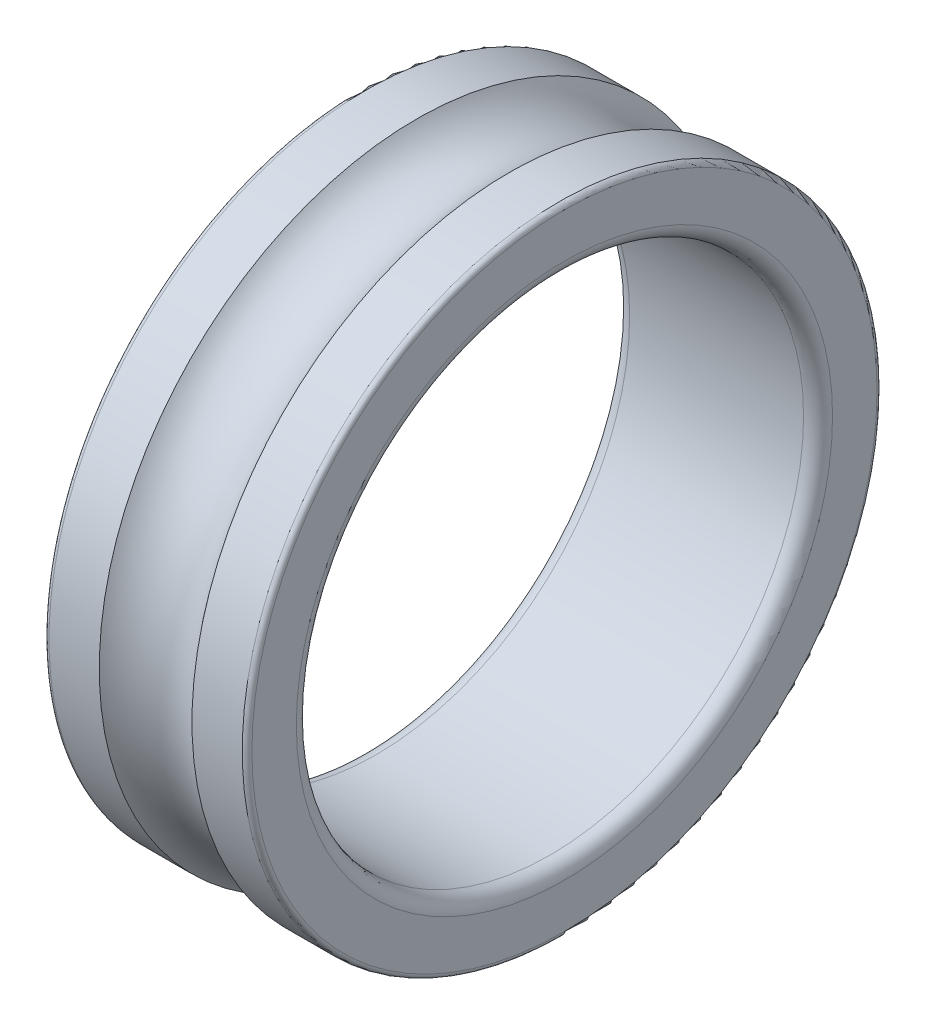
from build123d import *


with BuildPart() as part:
    # Esquisse1 → R_volution1 (revolve)
    with BuildSketch(Plane.XY, mode=Mode.PRIVATE) as r_volution1_sk:
        with BuildLine():
            Line((1, 17.5), (13, 17.5))
            ThreePointArc((13, 17.5), (13.707106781, 17.792893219), (14, 18.5))
            Line((14, 18.5), (14, 21.567))
            ThreePointArc((14, 21.567), (13.902466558, 21.802466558), (13.667, 21.9))
            Line((13.667, 21.9), (10.198509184, 21.9))
            ThreePointArc((10.198509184, 21.9), (7, 20.281), (3.801490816, 21.9))
            Line((3.801490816, 21.9), (0.333, 21.9))
            ThreePointArc((0.333, 21.9), (0.097533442, 21.802466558), (0, 21.567))
            Line((0, 21.567), (0, 18.5))
            ThreePointArc((0, 18.5), (0.292893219, 17.792893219), (1, 17.5))
        make_face()
    revolve(r_volution1_sk.sketch.rotate(Axis((13, 0, 0), (-1, 0, 0)), 90), axis=Axis((13, 0, 0), (-1, 0, 0)))


solid = part.part
